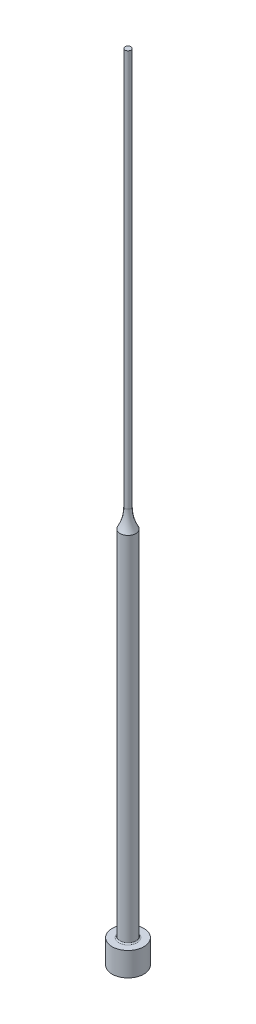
from build123d import *


with BuildPart() as part:
    # Sketch1 → Revolve1 (revolve)
    with BuildSketch(Plane.XY, mode=Mode.PRIVATE) as revolve1_sk:
        with BuildLine():
            Line((0, 0), (4, 0))
            Line((4, 0), (4, 6))
            Line((4, 6), (2.3, 6))
            ThreePointArc((2.3, 6), (2.087867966, 6.087867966), (2, 6.3))
            Line((2, 6.3), (2, 95.158770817))
            ThreePointArc((2, 95.158770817), (1.067541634, 97.5), (0.75, 100))
            Line((0.75, 100), (0.75, 200))
            Line((0.75, 200), (0, 200))
            Line((0, 200), (0, 0))
        make_face()
    revolve(revolve1_sk.sketch.rotate(Axis((0, 200, 0), (0, -1, 0)), 180), axis=Axis((0, 200, 0), (0, -1, 0)))


solid = part.part
